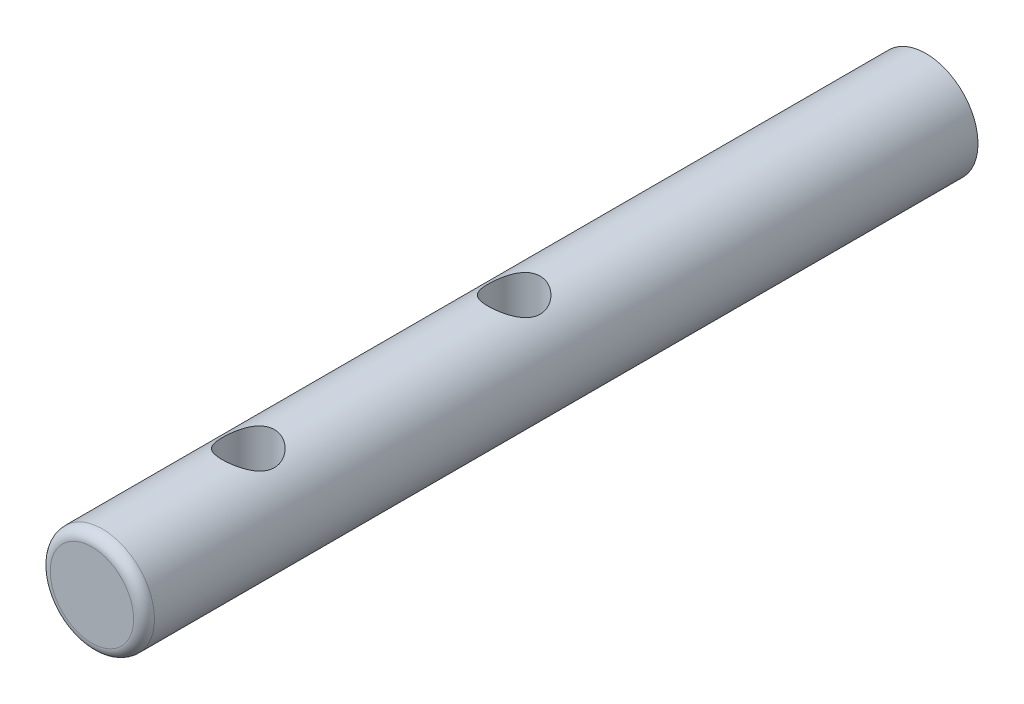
ISO-10303-21;
HEADER;
FILE_DESCRIPTION(('STEP AP214'),'2;1');
FILE_NAME('part.step','',(''),(''),'','','');
FILE_SCHEMA(('AUTOMOTIVE_DESIGN { 1 0 10303 214 1 1 1 1 }'));
ENDSEC;
DATA;
#1=APPLICATION_CONTEXT('core data for automotive mechanical design processes');
#2=APPLICATION_PROTOCOL_DEFINITION('international standard','automotive_design',2000,#1);
#3=PRODUCT_CONTEXT('',#1,'mechanical');
#4=PRODUCT('Part','Part','',(#3));
#5=PRODUCT_RELATED_PRODUCT_CATEGORY('part','',(#4));
#6=PRODUCT_DEFINITION_FORMATION('','',#4);
#7=PRODUCT_DEFINITION_CONTEXT('part definition',#1,'design');
#8=PRODUCT_DEFINITION('design','',#6,#7);
#9=PRODUCT_DEFINITION_SHAPE('','',#8);
#10=(LENGTH_UNIT() NAMED_UNIT(*) SI_UNIT(.MILLI.,.METRE.));
#11=(NAMED_UNIT(*) PLANE_ANGLE_UNIT() SI_UNIT($,.RADIAN.));
#12=(NAMED_UNIT(*) SI_UNIT($,.STERADIAN.) SOLID_ANGLE_UNIT());
#13=UNCERTAINTY_MEASURE_WITH_UNIT(LENGTH_MEASURE(1.E-05),#10,'distance_accuracy_value','');
#14=(GEOMETRIC_REPRESENTATION_CONTEXT(3) GLOBAL_UNCERTAINTY_ASSIGNED_CONTEXT((#13)) GLOBAL_UNIT_ASSIGNED_CONTEXT((#10,
#11,#12)) REPRESENTATION_CONTEXT('',''));
#15=CARTESIAN_POINT('',(0.,0.,0.));
#16=DIRECTION('',(0.,0.,1.));
#17=DIRECTION('',(1.,0.,0.));
#18=AXIS2_PLACEMENT_3D('',#15,#16,#17);
#19=CARTESIAN_POINT('',(0.,0.,101.6));
#20=DIRECTION('',(0.,0.,-1.));
#21=DIRECTION('',(-1.,0.,0.));
#22=AXIS2_PLACEMENT_3D('',#19,#20,#21);
#23=CYLINDRICAL_SURFACE('',#22,6.35);
#24=CARTESIAN_POINT('',(1.52655665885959E-13,6.35,46.9899999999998));
#25=CARTESIAN_POINT('',(0.0834969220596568,6.34999931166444,46.9900008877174));
#26=CARTESIAN_POINT('',(0.167002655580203,6.34834758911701,46.9932998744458));
#27=CARTESIAN_POINT('',(0.333378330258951,6.34179105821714,47.0064458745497));
#28=CARTESIAN_POINT('',(0.416247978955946,6.33688483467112,47.0162957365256));
#29=CARTESIAN_POINT('',(0.663182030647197,6.31742426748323,47.0555720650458));
#30=CARTESIAN_POINT('',(0.825450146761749,6.29812827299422,47.0947250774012));
#31=CARTESIAN_POINT('',(1.13965128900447,6.24891823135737,47.196990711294));
#32=CARTESIAN_POINT('',(1.2916218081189,6.2190454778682,47.2600102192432));
#33=CARTESIAN_POINT('',(1.58264035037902,6.15142812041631,47.4077360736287));
#34=CARTESIAN_POINT('',(1.72168939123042,6.1136841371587,47.4924407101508));
#35=CARTESIAN_POINT('',(1.99234108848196,6.03111096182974,47.6869696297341));
#36=CARTESIAN_POINT('',(2.12298433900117,5.98599127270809,47.7980035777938));
#37=CARTESIAN_POINT('',(2.36467069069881,5.89470535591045,48.0393966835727));
#38=CARTESIAN_POINT('',(2.47569885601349,5.84853836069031,48.1697704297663));
#39=CARTESIAN_POINT('',(2.68368848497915,5.75623634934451,48.4584209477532));
#40=CARTESIAN_POINT('',(2.77889135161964,5.71038146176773,48.6180775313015));
#41=CARTESIAN_POINT('',(2.90019349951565,5.64919759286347,48.8695479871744));
#42=CARTESIAN_POINT('',(2.93705266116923,5.63006420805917,48.9554000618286));
#43=CARTESIAN_POINT('',(3.00322508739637,5.59504604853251,49.1305856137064));
#44=CARTESIAN_POINT('',(3.0325428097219,5.57915935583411,49.2199169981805));
#45=CARTESIAN_POINT('',(3.08174263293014,5.55212611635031,49.3960105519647));
#46=CARTESIAN_POINT('',(3.1020812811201,5.54075429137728,49.4826107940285));
#47=CARTESIAN_POINT('',(3.13545600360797,5.52193654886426,49.6575872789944));
#48=CARTESIAN_POINT('',(3.1484959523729,5.51448854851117,49.7459625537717));
#49=CARTESIAN_POINT('',(3.16707713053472,5.503838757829,49.9237067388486));
#50=CARTESIAN_POINT('',(3.17262287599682,5.50063441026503,50.0130750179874));
#51=CARTESIAN_POINT('',(3.17614778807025,5.4985978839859,50.1919807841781));
#52=CARTESIAN_POINT('',(3.17412767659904,5.4997652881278,50.2815182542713));
#53=CARTESIAN_POINT('',(3.15811930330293,5.50899190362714,50.5277478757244));
#54=CARTESIAN_POINT('',(3.13621253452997,5.52160857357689,50.6838417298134));
#55=CARTESIAN_POINT('',(3.070037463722,5.55866493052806,50.9896466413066));
#56=CARTESIAN_POINT('',(3.02576203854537,5.58310838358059,51.1393556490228));
#57=CARTESIAN_POINT('',(2.91531509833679,5.6415788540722,51.4325442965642));
#58=CARTESIAN_POINT('',(2.8486575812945,5.67581583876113,51.5757976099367));
#59=CARTESIAN_POINT('',(2.69570761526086,5.75003268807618,51.8497660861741));
#60=CARTESIAN_POINT('',(2.60940634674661,5.79001512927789,51.9804755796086));
#61=CARTESIAN_POINT('',(2.40685964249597,5.87734289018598,52.2431042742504));
#62=CARTESIAN_POINT('',(2.28820488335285,5.92497898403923,52.3730753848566));
#63=CARTESIAN_POINT('',(2.03058898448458,6.01813700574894,52.6120851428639));
#64=CARTESIAN_POINT('',(1.89161819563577,6.06365791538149,52.7211137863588));
#65=CARTESIAN_POINT('',(1.58913989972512,6.15003810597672,52.9199019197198));
#66=CARTESIAN_POINT('',(1.42479265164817,6.19058274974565,53.0085314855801));
#67=CARTESIAN_POINT('',(1.08098023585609,6.25976272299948,53.1561580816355));
#68=CARTESIAN_POINT('',(0.901527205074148,6.28840750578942,53.2151786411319));
#69=CARTESIAN_POINT('',(0.548533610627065,6.32854759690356,53.2970594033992));
#70=CARTESIAN_POINT('',(0.375734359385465,6.34126679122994,53.3225096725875));
#71=CARTESIAN_POINT('',(0.0278752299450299,6.35231817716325,53.3446505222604));
#72=CARTESIAN_POINT('',(-0.147183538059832,6.3506571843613,53.3413547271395));
#73=CARTESIAN_POINT('',(-0.480164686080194,6.333845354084,53.3075937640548));
#74=CARTESIAN_POINT('',(-0.63836362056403,6.31975005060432,53.2792542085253));
#75=CARTESIAN_POINT('',(-0.947441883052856,6.28085393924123,53.1995441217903));
#76=CARTESIAN_POINT('',(-1.09832040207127,6.25605195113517,53.1481710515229));
#77=CARTESIAN_POINT('',(-1.393471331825,6.19709998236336,53.0225048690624));
#78=CARTESIAN_POINT('',(-1.53743151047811,6.1627029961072,52.947598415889));
#79=CARTESIAN_POINT('',(-1.8112148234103,6.08787118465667,52.7776835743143));
#80=CARTESIAN_POINT('',(-1.94103189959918,6.04743378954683,52.6826666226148));
#81=CARTESIAN_POINT('',(-2.19636241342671,5.95973602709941,52.4644606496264));
#82=CARTESIAN_POINT('',(-2.32020134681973,5.91219559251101,52.3394213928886));
#83=CARTESIAN_POINT('',(-2.54589381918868,5.81858093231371,52.0702376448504));
#84=CARTESIAN_POINT('',(-2.64773214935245,5.77250773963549,51.9260800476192));
#85=CARTESIAN_POINT('',(-2.83117262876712,5.68487535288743,51.6139313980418));
#86=CARTESIAN_POINT('',(-2.91155594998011,5.64364281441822,51.4451242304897));
#87=CARTESIAN_POINT('',(-3.04191297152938,5.5744767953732,51.0936555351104));
#88=CARTESIAN_POINT('',(-3.09192585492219,5.54652618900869,50.9110122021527));
#89=CARTESIAN_POINT('',(-3.15551086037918,5.51057765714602,50.5558100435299));
#90=CARTESIAN_POINT('',(-3.17212027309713,5.50092192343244,50.3839662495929));
#91=CARTESIAN_POINT('',(-3.17718805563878,5.49800001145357,50.0397555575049));
#92=CARTESIAN_POINT('',(-3.16565862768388,5.50472672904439,49.8673889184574));
#93=CARTESIAN_POINT('',(-3.11761548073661,5.53205211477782,49.5443398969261));
#94=CARTESIAN_POINT('',(-3.08358651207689,5.55126823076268,49.3931560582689));
#95=CARTESIAN_POINT('',(-2.9945816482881,5.5997797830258,49.0988091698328));
#96=CARTESIAN_POINT('',(-2.93959901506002,5.62907846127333,48.9556487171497));
#97=CARTESIAN_POINT('',(-2.80611544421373,5.69685576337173,48.6707663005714));
#98=CARTESIAN_POINT('',(-2.72628260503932,5.73581889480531,48.5297871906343));
#99=CARTESIAN_POINT('',(-2.54682759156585,5.81772207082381,48.2623025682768));
#100=CARTESIAN_POINT('',(-2.44719512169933,5.86066417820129,48.1358046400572));
#101=CARTESIAN_POINT('',(-2.2168028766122,5.95192753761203,47.8849024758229));
#102=CARTESIAN_POINT('',(-2.08373188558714,6.00026839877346,47.7626202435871));
#103=CARTESIAN_POINT('',(-1.79751265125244,6.0921234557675,47.5416021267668));
#104=CARTESIAN_POINT('',(-1.64435365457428,6.13563504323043,47.4428789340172));
#105=CARTESIAN_POINT('',(-1.40178715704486,6.19391073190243,47.3147197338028));
#106=CARTESIAN_POINT('',(-1.31842200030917,6.21223173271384,47.2751994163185));
#107=CARTESIAN_POINT('',(-1.14807701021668,6.24595363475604,47.2034005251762));
#108=CARTESIAN_POINT('',(-1.06109897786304,6.26135597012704,47.1711183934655));
#109=CARTESIAN_POINT('',(-0.884361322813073,6.28875097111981,47.1142406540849));
#110=CARTESIAN_POINT('',(-0.794608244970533,6.30075106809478,47.0896282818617));
#111=CARTESIAN_POINT('',(-0.612925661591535,6.32100983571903,47.0483326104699));
#112=CARTESIAN_POINT('',(-0.520997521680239,6.32927079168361,47.0316444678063));
#113=CARTESIAN_POINT('',(-0.357531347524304,6.34032503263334,47.0093837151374));
#114=CARTESIAN_POINT('',(-0.286274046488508,6.34394670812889,47.0021211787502));
#115=CARTESIAN_POINT('',(-0.143346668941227,6.34878452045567,46.9924288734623));
#116=CARTESIAN_POINT('',(-0.0716765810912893,6.35000059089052,46.989999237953));
#117=CARTESIAN_POINT('',(1.52655665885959E-13,6.35,46.9899999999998));
#118=B_SPLINE_CURVE_WITH_KNOTS('',3,(#24,#25,#26,#27,#28,#29,#30,#31,#32,#33,#34,#35,#36,#37,
#38,#39,#40,#41,#42,#43,#44,#45,#46,#47,#48,#49,#50,#51,#52,#53,#54,#55,#56,#57,#58,#59,#60,#61,
#62,#63,#64,#65,#66,#67,#68,#69,#70,#71,#72,#73,#74,#75,#76,#77,#78,#79,#80,#81,#82,#83,#84,#85,
#86,#87,#88,#89,#90,#91,#92,#93,#94,#95,#96,#97,#98,#99,#100,#101,#102,#103,#104,#105,#106,#107,
#108,#109,#110,#111,#112,#113,#114,#115,#116,#117),.UNSPECIFIED.,.T.,.F.,(4,2,2,2,2,2,2,2,2,2,2,
2,2,2,2,2,2,2,2,2,2,2,2,2,2,2,2,2,2,2,2,2,2,2,2,2,2,2,2,2,2,2,2,2,2,2,4),(0.,0.250415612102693,
0.50094018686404,1.00234854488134,1.50182051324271,2.00125310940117,2.53090025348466,
3.06094897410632,3.6321029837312,3.91787290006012,4.20347350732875,4.4721327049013,
4.74064915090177,5.00900371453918,5.27733267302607,5.74927594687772,6.22136960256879,
6.70445970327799,7.18776712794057,7.7323564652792,8.27720530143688,8.84735553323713,
9.41705196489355,9.93956405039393,10.4618285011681,10.9436138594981,11.4254523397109,
11.9210677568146,12.4168946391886,12.9614122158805,13.5063050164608,14.0775857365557,
14.648127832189,15.1639000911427,15.6794487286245,16.1458838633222,16.6124691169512,
17.1104020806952,17.6085946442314,18.1673210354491,18.7263477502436,19.0082017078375,
19.2899168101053,19.5710117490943,19.8519346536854,20.0668939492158,20.2818591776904),.UNSPECIFIED.);
#119=CARTESIAN_POINT('',(1.52655665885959E-13,6.35,46.9899999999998));
#120=VERTEX_POINT('',#119);
#121=EDGE_CURVE('E11',#120,#120,#118,.T.);
#122=ORIENTED_EDGE('',*,*,#121,.T.);
#123=EDGE_LOOP('',(#122));
#124=FACE_BOUND('',#123,.T.);
#125=CARTESIAN_POINT('',(0.,-6.35,46.9899999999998));
#126=CARTESIAN_POINT('',(-0.0834969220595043,-6.34999931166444,46.9900008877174));
#127=CARTESIAN_POINT('',(-0.167002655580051,-6.34834758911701,46.9932998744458));
#128=CARTESIAN_POINT('',(-0.333378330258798,-6.34179105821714,47.0064458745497));
#129=CARTESIAN_POINT('',(-0.416247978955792,-6.33688483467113,47.0162957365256));
#130=CARTESIAN_POINT('',(-0.663182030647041,-6.31742426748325,47.0555720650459));
#131=CARTESIAN_POINT('',(-0.825450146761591,-6.29812827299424,47.0947250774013));
#132=CARTESIAN_POINT('',(-1.13965128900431,-6.24891823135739,47.196990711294));
#133=CARTESIAN_POINT('',(-1.29162180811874,-6.21904547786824,47.2600102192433));
#134=CARTESIAN_POINT('',(-1.58264035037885,-6.15142812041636,47.4077360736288));
#135=CARTESIAN_POINT('',(-1.72168939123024,-6.11368413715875,47.4924407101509));
#136=CARTESIAN_POINT('',(-1.99234108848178,-6.0311109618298,47.6869696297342));
#137=CARTESIAN_POINT('',(-2.12298433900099,-5.98599127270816,47.7980035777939));
#138=CARTESIAN_POINT('',(-2.36467069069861,-5.89470535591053,48.0393966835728));
#139=CARTESIAN_POINT('',(-2.47569885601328,-5.8485383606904,48.1697704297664));
#140=CARTESIAN_POINT('',(-2.68368848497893,-5.75623634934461,48.4584209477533));
#141=CARTESIAN_POINT('',(-2.77889135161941,-5.71038146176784,48.6180775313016));
#142=CARTESIAN_POINT('',(-2.90019349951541,-5.6491975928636,48.8695479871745));
#143=CARTESIAN_POINT('',(-2.93705266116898,-5.63006420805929,48.9554000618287));
#144=CARTESIAN_POINT('',(-3.00322508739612,-5.59504604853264,49.1305856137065));
#145=CARTESIAN_POINT('',(-3.03254280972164,-5.57915935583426,49.2199169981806));
#146=CARTESIAN_POINT('',(-3.08174263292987,-5.55212611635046,49.3960105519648));
#147=CARTESIAN_POINT('',(-3.10208128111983,-5.54075429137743,49.4826107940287));
#148=CARTESIAN_POINT('',(-3.13545600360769,-5.52193654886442,49.6575872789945));
#149=CARTESIAN_POINT('',(-3.14849595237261,-5.51448854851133,49.7459625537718));
#150=CARTESIAN_POINT('',(-3.16707713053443,-5.50383875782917,49.9237067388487));
#151=CARTESIAN_POINT('',(-3.17262287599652,-5.5006344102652,50.0130750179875));
#152=CARTESIAN_POINT('',(-3.17614778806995,-5.49859788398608,50.1919807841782));
#153=CARTESIAN_POINT('',(-3.17412767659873,-5.49976528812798,50.2815182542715));
#154=CARTESIAN_POINT('',(-3.1581193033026,-5.50899190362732,50.5277478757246));
#155=CARTESIAN_POINT('',(-3.13621253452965,-5.52160857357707,50.6838417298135));
#156=CARTESIAN_POINT('',(-3.07003746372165,-5.55866493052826,50.9896466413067));
#157=CARTESIAN_POINT('',(-3.02576203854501,-5.58310838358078,51.1393556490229));
#158=CARTESIAN_POINT('',(-2.91531509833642,-5.64157885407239,51.4325442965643));
#159=CARTESIAN_POINT('',(-2.84865758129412,-5.67581583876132,51.5757976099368));
#160=CARTESIAN_POINT('',(-2.69570761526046,-5.75003268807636,51.8497660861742));
#161=CARTESIAN_POINT('',(-2.6094063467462,-5.79001512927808,51.9804755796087));
#162=CARTESIAN_POINT('',(-2.40685964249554,-5.87734289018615,52.2431042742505));
#163=CARTESIAN_POINT('',(-2.2882048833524,-5.92497898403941,52.3730753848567));
#164=CARTESIAN_POINT('',(-2.03058898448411,-6.0181370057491,52.6120851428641));
#165=CARTESIAN_POINT('',(-1.89161819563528,-6.06365791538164,52.7211137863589));
#166=CARTESIAN_POINT('',(-1.58913989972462,-6.15003810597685,52.9199019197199));
#167=CARTESIAN_POINT('',(-1.42479265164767,-6.19058274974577,53.0085314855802));
#168=CARTESIAN_POINT('',(-1.08098023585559,-6.25976272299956,53.1561580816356));
#169=CARTESIAN_POINT('',(-0.901527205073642,-6.2884075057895,53.2151786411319));
#170=CARTESIAN_POINT('',(-0.548533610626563,-6.3285475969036,53.2970594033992));
#171=CARTESIAN_POINT('',(-0.375734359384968,-6.34126679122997,53.3225096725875));
#172=CARTESIAN_POINT('',(-0.0278752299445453,-6.35231817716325,53.3446505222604));
#173=CARTESIAN_POINT('',(0.147183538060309,-6.35065718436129,53.3413547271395));
#174=CARTESIAN_POINT('',(0.480164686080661,-6.33384535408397,53.3075937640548));
#175=CARTESIAN_POINT('',(0.638363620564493,-6.31975005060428,53.2792542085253));
#176=CARTESIAN_POINT('',(0.94744188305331,-6.28085393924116,53.1995441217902));
#177=CARTESIAN_POINT('',(1.09832040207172,-6.25605195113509,53.1481710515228));
#178=CARTESIAN_POINT('',(1.39347133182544,-6.19709998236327,53.0225048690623));
#179=CARTESIAN_POINT('',(1.53743151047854,-6.16270299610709,52.9475984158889));
#180=CARTESIAN_POINT('',(1.81121482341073,-6.08787118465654,52.7776835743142));
#181=CARTESIAN_POINT('',(1.94103189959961,-6.04743378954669,52.6826666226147));
#182=CARTESIAN_POINT('',(2.19636241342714,-5.95973602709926,52.4644606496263));
#183=CARTESIAN_POINT('',(2.32020134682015,-5.91219559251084,52.3394213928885));
#184=CARTESIAN_POINT('',(2.54589381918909,-5.81858093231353,52.0702376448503));
#185=CARTESIAN_POINT('',(2.64773214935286,-5.7725077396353,51.9260800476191));
#186=CARTESIAN_POINT('',(2.83117262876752,-5.68487535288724,51.6139313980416));
#187=CARTESIAN_POINT('',(2.91155594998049,-5.64364281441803,51.4451242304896));
#188=CARTESIAN_POINT('',(3.04191297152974,-5.57447679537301,51.0936555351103));
#189=CARTESIAN_POINT('',(3.09192585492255,-5.54652618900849,50.9110122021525));
#190=CARTESIAN_POINT('',(3.15551086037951,-5.51057765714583,50.5558100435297));
#191=CARTESIAN_POINT('',(3.17212027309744,-5.50092192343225,50.3839662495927));
#192=CARTESIAN_POINT('',(3.17718805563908,-5.4980000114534,50.0397555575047));
#193=CARTESIAN_POINT('',(3.16565862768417,-5.50472672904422,49.8673889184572));
#194=CARTESIAN_POINT('',(3.11761548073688,-5.53205211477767,49.5443398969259));
#195=CARTESIAN_POINT('',(3.08358651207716,-5.55126823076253,49.3931560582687));
#196=CARTESIAN_POINT('',(2.99458164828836,-5.59977978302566,49.0988091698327));
#197=CARTESIAN_POINT('',(2.93959901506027,-5.6290784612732,48.9556487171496));
#198=CARTESIAN_POINT('',(2.80611544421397,-5.69685576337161,48.6707663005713));
#199=CARTESIAN_POINT('',(2.72628260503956,-5.7358188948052,48.5297871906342));
#200=CARTESIAN_POINT('',(2.54682759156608,-5.81772207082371,48.2623025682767));
#201=CARTESIAN_POINT('',(2.44719512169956,-5.8606641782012,48.1358046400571));
#202=CARTESIAN_POINT('',(2.21680287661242,-5.95192753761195,47.8849024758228));
#203=CARTESIAN_POINT('',(2.08373188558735,-6.00026839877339,47.762620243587));
#204=CARTESIAN_POINT('',(1.79751265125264,-6.09212345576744,47.5416021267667));
#205=CARTESIAN_POINT('',(1.64435365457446,-6.13563504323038,47.4428789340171));
#206=CARTESIAN_POINT('',(1.40178715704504,-6.19391073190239,47.3147197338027));
#207=CARTESIAN_POINT('',(1.31842200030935,-6.2122317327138,47.2751994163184));
#208=CARTESIAN_POINT('',(1.14807701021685,-6.24595363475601,47.2034005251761));
#209=CARTESIAN_POINT('',(1.0610989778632,-6.26135597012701,47.1711183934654));
#210=CARTESIAN_POINT('',(0.884361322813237,-6.28875097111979,47.1142406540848));
#211=CARTESIAN_POINT('',(0.794608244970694,-6.30075106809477,47.0896282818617));
#212=CARTESIAN_POINT('',(0.612925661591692,-6.32100983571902,47.0483326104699));
#213=CARTESIAN_POINT('',(0.520997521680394,-6.32927079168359,47.0316444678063));
#214=CARTESIAN_POINT('',(0.357531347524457,-6.34032503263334,47.0093837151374));
#215=CARTESIAN_POINT('',(0.286274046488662,-6.34394670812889,47.0021211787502));
#216=CARTESIAN_POINT('',(0.143346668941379,-6.34878452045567,46.9924288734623));
#217=CARTESIAN_POINT('',(0.0716765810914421,-6.35000059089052,46.989999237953));
#218=CARTESIAN_POINT('',(0.,-6.35,46.9899999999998));
#219=B_SPLINE_CURVE_WITH_KNOTS('',3,(#125,#126,#127,#128,#129,#130,#131,#132,#133,#134,#135,
#136,#137,#138,#139,#140,#141,#142,#143,#144,#145,#146,#147,#148,#149,#150,#151,#152,#153,#154,
#155,#156,#157,#158,#159,#160,#161,#162,#163,#164,#165,#166,#167,#168,#169,#170,#171,#172,#173,
#174,#175,#176,#177,#178,#179,#180,#181,#182,#183,#184,#185,#186,#187,#188,#189,#190,#191,#192,
#193,#194,#195,#196,#197,#198,#199,#200,#201,#202,#203,#204,#205,#206,#207,#208,#209,#210,#211,
#212,#213,#214,#215,#216,#217,#218),.UNSPECIFIED.,.T.,.F.,(4,2,2,2,2,2,2,2,2,2,2,2,2,2,2,2,2,2,
2,2,2,2,2,2,2,2,2,2,2,2,2,2,2,2,2,2,2,2,2,2,2,2,2,2,2,2,4),(0.,0.250415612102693,
0.50094018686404,1.00234854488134,1.50182051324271,2.00125310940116,2.53090025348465,
3.06094897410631,3.63210298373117,3.91787290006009,4.20347350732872,4.47213270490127,
4.74064915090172,5.00900371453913,5.27733267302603,5.74927594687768,6.22136960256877,
6.70445970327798,7.18776712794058,7.73235646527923,8.27720530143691,8.84735553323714,
9.41705196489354,9.9395640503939,10.4618285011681,10.9436138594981,11.4254523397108,
11.9210677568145,12.4168946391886,12.9614122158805,13.5063050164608,14.0775857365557,
14.648127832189,15.1639000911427,15.6794487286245,16.1458838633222,16.6124691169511,
17.1104020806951,17.6085946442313,18.1673210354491,18.7263477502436,19.0082017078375,
19.2899168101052,19.5710117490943,19.8519346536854,20.0668939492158,20.2818591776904),.UNSPECIFIED.);
#220=CARTESIAN_POINT('',(0.,-6.35,46.9899999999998));
#221=VERTEX_POINT('',#220);
#222=EDGE_CURVE('E50',#221,#221,#219,.T.);
#223=ORIENTED_EDGE('',*,*,#222,.T.);
#224=EDGE_LOOP('',(#223));
#225=FACE_BOUND('',#224,.T.);
#226=CARTESIAN_POINT('',(0.,6.35,79.375));
#227=CARTESIAN_POINT('',(0.0834969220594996,6.34999931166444,79.3750008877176));
#228=CARTESIAN_POINT('',(0.167002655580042,6.34834758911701,79.378299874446));
#229=CARTESIAN_POINT('',(0.333378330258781,6.34179105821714,79.3914458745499));
#230=CARTESIAN_POINT('',(0.416247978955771,6.33688483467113,79.4012957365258));
#231=CARTESIAN_POINT('',(0.66318203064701,6.31742426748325,79.440572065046));
#232=CARTESIAN_POINT('',(0.825450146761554,6.29812827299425,79.4797250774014));
#233=CARTESIAN_POINT('',(1.13965128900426,6.2489182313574,79.5819907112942));
#234=CARTESIAN_POINT('',(1.29162180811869,6.21904547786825,79.6450102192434));
#235=CARTESIAN_POINT('',(1.58264035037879,6.15142812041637,79.7927360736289));
#236=CARTESIAN_POINT('',(1.72168939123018,6.11368413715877,79.877440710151));
#237=CARTESIAN_POINT('',(1.99234108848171,6.03111096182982,80.0719696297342));
#238=CARTESIAN_POINT('',(2.12298433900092,5.98599127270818,80.183003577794));
#239=CARTESIAN_POINT('',(2.36467069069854,5.89470535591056,80.4243966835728));
#240=CARTESIAN_POINT('',(2.47569885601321,5.84853836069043,80.5547704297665));
#241=CARTESIAN_POINT('',(2.68368848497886,5.75623634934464,80.8434209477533));
#242=CARTESIAN_POINT('',(2.77889135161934,5.71038146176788,81.0030775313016));
#243=CARTESIAN_POINT('',(2.90019349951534,5.64919759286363,81.2545479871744));
#244=CARTESIAN_POINT('',(2.93705266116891,5.63006420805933,81.3404000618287));
#245=CARTESIAN_POINT('',(3.00322508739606,5.59504604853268,81.5155856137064));
#246=CARTESIAN_POINT('',(3.03254280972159,5.57915935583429,81.6049169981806));
#247=CARTESIAN_POINT('',(3.08174263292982,5.55212611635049,81.7810105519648));
#248=CARTESIAN_POINT('',(3.10208128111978,5.54075429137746,81.8676107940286));
#249=CARTESIAN_POINT('',(3.13545600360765,5.52193654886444,82.0425872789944));
#250=CARTESIAN_POINT('',(3.14849595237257,5.51448854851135,82.1309625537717));
#251=CARTESIAN_POINT('',(3.1670771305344,5.50383875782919,82.3087067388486));
#252=CARTESIAN_POINT('',(3.17262287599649,5.50063441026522,82.3980750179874));
#253=CARTESIAN_POINT('',(3.17614778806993,5.49859788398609,82.5769807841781));
#254=CARTESIAN_POINT('',(3.17412767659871,5.49976528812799,82.6665182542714));
#255=CARTESIAN_POINT('',(3.1581193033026,5.50899190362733,82.9127478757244));
#256=CARTESIAN_POINT('',(3.13621253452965,5.52160857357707,83.0688417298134));
#257=CARTESIAN_POINT('',(3.07003746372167,5.55866493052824,83.3746466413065));
#258=CARTESIAN_POINT('',(3.02576203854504,5.58310838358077,83.5243556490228));
#259=CARTESIAN_POINT('',(2.91531509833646,5.64157885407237,83.8175442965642));
#260=CARTESIAN_POINT('',(2.84865758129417,5.6758158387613,83.9607976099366));
#261=CARTESIAN_POINT('',(2.69570761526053,5.75003268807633,84.234766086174));
#262=CARTESIAN_POINT('',(2.60940634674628,5.79001512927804,84.3654755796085));
#263=CARTESIAN_POINT('',(2.40685964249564,5.87734289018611,84.6281042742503));
#264=CARTESIAN_POINT('',(2.28820488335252,5.92497898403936,84.7580753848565));
#265=CARTESIAN_POINT('',(2.03058898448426,6.01813700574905,84.9970851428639));
#266=CARTESIAN_POINT('',(1.89161819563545,6.06365791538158,85.1061137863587));
#267=CARTESIAN_POINT('',(1.58913989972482,6.1500381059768,85.3049019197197));
#268=CARTESIAN_POINT('',(1.42479265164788,6.19058274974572,85.3935314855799));
#269=CARTESIAN_POINT('',(1.08098023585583,6.25976272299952,85.5411580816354));
#270=CARTESIAN_POINT('',(0.901527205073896,6.28840750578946,85.6001786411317));
#271=CARTESIAN_POINT('',(0.548533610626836,6.32854759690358,85.6820594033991));
#272=CARTESIAN_POINT('',(0.375734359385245,6.34126679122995,85.7075096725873));
#273=CARTESIAN_POINT('',(0.0278752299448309,6.35231817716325,85.7296505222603));
#274=CARTESIAN_POINT('',(-0.147183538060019,6.35065718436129,85.7263547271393));
#275=CARTESIAN_POINT('',(-0.480164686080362,6.33384535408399,85.6925937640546));
#276=CARTESIAN_POINT('',(-0.638363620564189,6.31975005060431,85.6642542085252));
#277=CARTESIAN_POINT('',(-0.947441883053,6.28085393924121,85.5845441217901));
#278=CARTESIAN_POINT('',(-1.09832040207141,6.25605195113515,85.5331710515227));
#279=CARTESIAN_POINT('',(-1.39347133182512,6.19709998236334,85.4075048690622));
#280=CARTESIAN_POINT('',(-1.53743151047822,6.16270299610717,85.3325984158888));
#281=CARTESIAN_POINT('',(-1.8112148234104,6.08787118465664,85.1626835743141));
#282=CARTESIAN_POINT('',(-1.94103189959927,6.0474337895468,85.0676666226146));
#283=CARTESIAN_POINT('',(-2.19636241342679,5.95973602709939,84.8494606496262));
#284=CARTESIAN_POINT('',(-2.3202013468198,5.91219559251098,84.7244213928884));
#285=CARTESIAN_POINT('',(-2.54589381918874,5.81858093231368,84.4552376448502));
#286=CARTESIAN_POINT('',(-2.6477321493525,5.77250773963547,84.3110800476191));
#287=CARTESIAN_POINT('',(-2.83117262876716,5.68487535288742,83.9989313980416));
#288=CARTESIAN_POINT('',(-2.91155594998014,5.64364281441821,83.8301242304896));
#289=CARTESIAN_POINT('',(-3.04191297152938,5.5744767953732,83.4786555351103));
#290=CARTESIAN_POINT('',(-3.09192585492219,5.54652618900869,83.2960122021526));
#291=CARTESIAN_POINT('',(-3.15551086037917,5.51057765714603,82.9408100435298));
#292=CARTESIAN_POINT('',(-3.17212027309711,5.50092192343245,82.7689662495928));
#293=CARTESIAN_POINT('',(-3.17718805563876,5.49800001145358,82.4247555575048));
#294=CARTESIAN_POINT('',(-3.16565862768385,5.50472672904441,82.2523889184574));
#295=CARTESIAN_POINT('',(-3.11761548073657,5.53205211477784,81.9293398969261));
#296=CARTESIAN_POINT('',(-3.08358651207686,5.5512682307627,81.7781560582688));
#297=CARTESIAN_POINT('',(-2.99458164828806,5.59977978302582,81.4838091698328));
#298=CARTESIAN_POINT('',(-2.93959901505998,5.62907846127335,81.3406487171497));
#299=CARTESIAN_POINT('',(-2.80611544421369,5.69685576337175,81.0557663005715));
#300=CARTESIAN_POINT('',(-2.72628260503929,5.73581889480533,80.9147871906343));
#301=CARTESIAN_POINT('',(-2.54682759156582,5.81772207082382,80.6473025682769));
#302=CARTESIAN_POINT('',(-2.4471951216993,5.86066417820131,80.5208046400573));
#303=CARTESIAN_POINT('',(-2.21680287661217,5.95192753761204,80.2699024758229));
#304=CARTESIAN_POINT('',(-2.08373188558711,6.00026839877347,80.1476202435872));
#305=CARTESIAN_POINT('',(-1.79751265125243,6.0921234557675,79.9266021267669));
#306=CARTESIAN_POINT('',(-1.64435365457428,6.13563504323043,79.8278789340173));
#307=CARTESIAN_POINT('',(-1.40178715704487,6.19391073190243,79.6997197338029));
#308=CARTESIAN_POINT('',(-1.31842200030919,6.21223173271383,79.6601994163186));
#309=CARTESIAN_POINT('',(-1.14807701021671,6.24595363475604,79.5884005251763));
#310=CARTESIAN_POINT('',(-1.06109897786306,6.26135597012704,79.5561183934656));
#311=CARTESIAN_POINT('',(-0.884361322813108,6.28875097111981,79.499240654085));
#312=CARTESIAN_POINT('',(-0.794608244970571,6.30075106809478,79.4746282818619));
#313=CARTESIAN_POINT('',(-0.61292566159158,6.32100983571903,79.4333326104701));
#314=CARTESIAN_POINT('',(-0.520997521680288,6.3292707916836,79.4166444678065));
#315=CARTESIAN_POINT('',(-0.357531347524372,6.34032503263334,79.3943837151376));
#316=CARTESIAN_POINT('',(-0.286274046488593,6.34394670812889,79.3871211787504));
#317=CARTESIAN_POINT('',(-0.143346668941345,6.34878452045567,79.3774288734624));
#318=CARTESIAN_POINT('',(-0.0716765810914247,6.35000059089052,79.3749992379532));
#319=CARTESIAN_POINT('',(0.,6.35,79.375));
#320=B_SPLINE_CURVE_WITH_KNOTS('',3,(#226,#227,#228,#229,#230,#231,#232,#233,#234,#235,#236,
#237,#238,#239,#240,#241,#242,#243,#244,#245,#246,#247,#248,#249,#250,#251,#252,#253,#254,#255,
#256,#257,#258,#259,#260,#261,#262,#263,#264,#265,#266,#267,#268,#269,#270,#271,#272,#273,#274,
#275,#276,#277,#278,#279,#280,#281,#282,#283,#284,#285,#286,#287,#288,#289,#290,#291,#292,#293,
#294,#295,#296,#297,#298,#299,#300,#301,#302,#303,#304,#305,#306,#307,#308,#309,#310,#311,#312,
#313,#314,#315,#316,#317,#318,#319),.UNSPECIFIED.,.T.,.F.,(4,2,2,2,2,2,2,2,2,2,2,2,2,2,2,2,2,2,
2,2,2,2,2,2,2,2,2,2,2,2,2,2,2,2,2,2,2,2,2,2,2,2,2,2,2,2,4),(0.,0.25041561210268,
0.500940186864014,1.00234854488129,1.50182051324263,2.00125310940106,2.53090025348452,
3.06094897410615,3.63210298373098,3.91787290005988,4.20347350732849,4.47213270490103,
4.74064915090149,5.00900371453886,5.27733267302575,5.74927594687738,6.22136960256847,
6.70445970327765,7.18776712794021,7.73235646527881,8.27720530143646,8.84735553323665,
9.41705196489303,9.93956405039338,10.4618285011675,10.9436138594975,11.4254523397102,
11.9210677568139,12.4168946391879,12.9614122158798,13.5063050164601,14.0775857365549,
14.6481278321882,15.1639000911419,15.6794487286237,16.1458838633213,16.6124691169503,
17.1104020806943,17.6085946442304,18.1673210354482,18.7263477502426,19.0082017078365,
19.2899168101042,19.5710117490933,19.8519346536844,20.0668939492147,20.2818591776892),.UNSPECIFIED.);
#321=CARTESIAN_POINT('',(0.,6.35,79.375));
#322=VERTEX_POINT('',#321);
#323=EDGE_CURVE('E84',#322,#322,#320,.T.);
#324=ORIENTED_EDGE('',*,*,#323,.T.);
#325=EDGE_LOOP('',(#324));
#326=FACE_BOUND('',#325,.T.);
#327=CARTESIAN_POINT('',(0.,-6.35,79.375));
#328=CARTESIAN_POINT('',(-0.0834969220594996,-6.34999931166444,79.3750008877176));
#329=CARTESIAN_POINT('',(-0.167002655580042,-6.34834758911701,79.378299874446));
#330=CARTESIAN_POINT('',(-0.333378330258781,-6.34179105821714,79.3914458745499));
#331=CARTESIAN_POINT('',(-0.416247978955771,-6.33688483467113,79.4012957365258));
#332=CARTESIAN_POINT('',(-0.66318203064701,-6.31742426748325,79.440572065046));
#333=CARTESIAN_POINT('',(-0.825450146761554,-6.29812827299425,79.4797250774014));
#334=CARTESIAN_POINT('',(-1.13965128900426,-6.2489182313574,79.5819907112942));
#335=CARTESIAN_POINT('',(-1.29162180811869,-6.21904547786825,79.6450102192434));
#336=CARTESIAN_POINT('',(-1.58264035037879,-6.15142812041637,79.7927360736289));
#337=CARTESIAN_POINT('',(-1.72168939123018,-6.11368413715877,79.877440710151));
#338=CARTESIAN_POINT('',(-1.99234108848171,-6.03111096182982,80.0719696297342));
#339=CARTESIAN_POINT('',(-2.12298433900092,-5.98599127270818,80.183003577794));
#340=CARTESIAN_POINT('',(-2.36467069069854,-5.89470535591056,80.4243966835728));
#341=CARTESIAN_POINT('',(-2.47569885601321,-5.84853836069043,80.5547704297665));
#342=CARTESIAN_POINT('',(-2.68368848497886,-5.75623634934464,80.8434209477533));
#343=CARTESIAN_POINT('',(-2.77889135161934,-5.71038146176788,81.0030775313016));
#344=CARTESIAN_POINT('',(-2.90019349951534,-5.64919759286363,81.2545479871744));
#345=CARTESIAN_POINT('',(-2.93705266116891,-5.63006420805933,81.3404000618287));
#346=CARTESIAN_POINT('',(-3.00322508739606,-5.59504604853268,81.5155856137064));
#347=CARTESIAN_POINT('',(-3.03254280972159,-5.57915935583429,81.6049169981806));
#348=CARTESIAN_POINT('',(-3.08174263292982,-5.55212611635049,81.7810105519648));
#349=CARTESIAN_POINT('',(-3.10208128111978,-5.54075429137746,81.8676107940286));
#350=CARTESIAN_POINT('',(-3.13545600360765,-5.52193654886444,82.0425872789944));
#351=CARTESIAN_POINT('',(-3.14849595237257,-5.51448854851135,82.1309625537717));
#352=CARTESIAN_POINT('',(-3.1670771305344,-5.50383875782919,82.3087067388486));
#353=CARTESIAN_POINT('',(-3.17262287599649,-5.50063441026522,82.3980750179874));
#354=CARTESIAN_POINT('',(-3.17614778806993,-5.49859788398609,82.5769807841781));
#355=CARTESIAN_POINT('',(-3.17412767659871,-5.49976528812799,82.6665182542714));
#356=CARTESIAN_POINT('',(-3.1581193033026,-5.50899190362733,82.9127478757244));
#357=CARTESIAN_POINT('',(-3.13621253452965,-5.52160857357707,83.0688417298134));
#358=CARTESIAN_POINT('',(-3.07003746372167,-5.55866493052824,83.3746466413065));
#359=CARTESIAN_POINT('',(-3.02576203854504,-5.58310838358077,83.5243556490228));
#360=CARTESIAN_POINT('',(-2.91531509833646,-5.64157885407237,83.8175442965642));
#361=CARTESIAN_POINT('',(-2.84865758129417,-5.6758158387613,83.9607976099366));
#362=CARTESIAN_POINT('',(-2.69570761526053,-5.75003268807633,84.234766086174));
#363=CARTESIAN_POINT('',(-2.60940634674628,-5.79001512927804,84.3654755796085));
#364=CARTESIAN_POINT('',(-2.40685964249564,-5.87734289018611,84.6281042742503));
#365=CARTESIAN_POINT('',(-2.28820488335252,-5.92497898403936,84.7580753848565));
#366=CARTESIAN_POINT('',(-2.03058898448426,-6.01813700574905,84.9970851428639));
#367=CARTESIAN_POINT('',(-1.89161819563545,-6.06365791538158,85.1061137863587));
#368=CARTESIAN_POINT('',(-1.58913989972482,-6.1500381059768,85.3049019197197));
#369=CARTESIAN_POINT('',(-1.42479265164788,-6.19058274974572,85.3935314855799));
#370=CARTESIAN_POINT('',(-1.08098023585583,-6.25976272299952,85.5411580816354));
#371=CARTESIAN_POINT('',(-0.901527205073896,-6.28840750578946,85.6001786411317));
#372=CARTESIAN_POINT('',(-0.548533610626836,-6.32854759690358,85.6820594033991));
#373=CARTESIAN_POINT('',(-0.375734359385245,-6.34126679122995,85.7075096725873));
#374=CARTESIAN_POINT('',(-0.0278752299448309,-6.35231817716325,85.7296505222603));
#375=CARTESIAN_POINT('',(0.147183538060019,-6.35065718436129,85.7263547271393));
#376=CARTESIAN_POINT('',(0.480164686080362,-6.33384535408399,85.6925937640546));
#377=CARTESIAN_POINT('',(0.638363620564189,-6.31975005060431,85.6642542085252));
#378=CARTESIAN_POINT('',(0.947441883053,-6.28085393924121,85.5845441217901));
#379=CARTESIAN_POINT('',(1.09832040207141,-6.25605195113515,85.5331710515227));
#380=CARTESIAN_POINT('',(1.39347133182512,-6.19709998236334,85.4075048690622));
#381=CARTESIAN_POINT('',(1.53743151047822,-6.16270299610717,85.3325984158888));
#382=CARTESIAN_POINT('',(1.8112148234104,-6.08787118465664,85.1626835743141));
#383=CARTESIAN_POINT('',(1.94103189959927,-6.0474337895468,85.0676666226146));
#384=CARTESIAN_POINT('',(2.19636241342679,-5.95973602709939,84.8494606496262));
#385=CARTESIAN_POINT('',(2.3202013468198,-5.91219559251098,84.7244213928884));
#386=CARTESIAN_POINT('',(2.54589381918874,-5.81858093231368,84.4552376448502));
#387=CARTESIAN_POINT('',(2.6477321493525,-5.77250773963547,84.3110800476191));
#388=CARTESIAN_POINT('',(2.83117262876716,-5.68487535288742,83.9989313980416));
#389=CARTESIAN_POINT('',(2.91155594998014,-5.64364281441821,83.8301242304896));
#390=CARTESIAN_POINT('',(3.04191297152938,-5.5744767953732,83.4786555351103));
#391=CARTESIAN_POINT('',(3.09192585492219,-5.54652618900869,83.2960122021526));
#392=CARTESIAN_POINT('',(3.15551086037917,-5.51057765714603,82.9408100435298));
#393=CARTESIAN_POINT('',(3.17212027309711,-5.50092192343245,82.7689662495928));
#394=CARTESIAN_POINT('',(3.17718805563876,-5.49800001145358,82.4247555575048));
#395=CARTESIAN_POINT('',(3.16565862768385,-5.50472672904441,82.2523889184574));
#396=CARTESIAN_POINT('',(3.11761548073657,-5.53205211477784,81.9293398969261));
#397=CARTESIAN_POINT('',(3.08358651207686,-5.5512682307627,81.7781560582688));
#398=CARTESIAN_POINT('',(2.99458164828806,-5.59977978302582,81.4838091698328));
#399=CARTESIAN_POINT('',(2.93959901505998,-5.62907846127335,81.3406487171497));
#400=CARTESIAN_POINT('',(2.80611544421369,-5.69685576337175,81.0557663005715));
#401=CARTESIAN_POINT('',(2.72628260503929,-5.73581889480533,80.9147871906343));
#402=CARTESIAN_POINT('',(2.54682759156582,-5.81772207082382,80.6473025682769));
#403=CARTESIAN_POINT('',(2.4471951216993,-5.86066417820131,80.5208046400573));
#404=CARTESIAN_POINT('',(2.21680287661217,-5.95192753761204,80.2699024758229));
#405=CARTESIAN_POINT('',(2.08373188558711,-6.00026839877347,80.1476202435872));
#406=CARTESIAN_POINT('',(1.79751265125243,-6.0921234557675,79.9266021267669));
#407=CARTESIAN_POINT('',(1.64435365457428,-6.13563504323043,79.8278789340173));
#408=CARTESIAN_POINT('',(1.40178715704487,-6.19391073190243,79.6997197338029));
#409=CARTESIAN_POINT('',(1.31842200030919,-6.21223173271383,79.6601994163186));
#410=CARTESIAN_POINT('',(1.14807701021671,-6.24595363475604,79.5884005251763));
#411=CARTESIAN_POINT('',(1.06109897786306,-6.26135597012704,79.5561183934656));
#412=CARTESIAN_POINT('',(0.884361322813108,-6.28875097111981,79.499240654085));
#413=CARTESIAN_POINT('',(0.794608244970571,-6.30075106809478,79.4746282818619));
#414=CARTESIAN_POINT('',(0.61292566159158,-6.32100983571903,79.4333326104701));
#415=CARTESIAN_POINT('',(0.520997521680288,-6.3292707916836,79.4166444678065));
#416=CARTESIAN_POINT('',(0.357531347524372,-6.34032503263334,79.3943837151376));
#417=CARTESIAN_POINT('',(0.286274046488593,-6.34394670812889,79.3871211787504));
#418=CARTESIAN_POINT('',(0.143346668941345,-6.34878452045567,79.3774288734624));
#419=CARTESIAN_POINT('',(0.0716765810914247,-6.35000059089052,79.3749992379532));
#420=CARTESIAN_POINT('',(0.,-6.35,79.375));
#421=B_SPLINE_CURVE_WITH_KNOTS('',3,(#327,#328,#329,#330,#331,#332,#333,#334,#335,#336,#337,
#338,#339,#340,#341,#342,#343,#344,#345,#346,#347,#348,#349,#350,#351,#352,#353,#354,#355,#356,
#357,#358,#359,#360,#361,#362,#363,#364,#365,#366,#367,#368,#369,#370,#371,#372,#373,#374,#375,
#376,#377,#378,#379,#380,#381,#382,#383,#384,#385,#386,#387,#388,#389,#390,#391,#392,#393,#394,
#395,#396,#397,#398,#399,#400,#401,#402,#403,#404,#405,#406,#407,#408,#409,#410,#411,#412,#413,
#414,#415,#416,#417,#418,#419,#420),.UNSPECIFIED.,.T.,.F.,(4,2,2,2,2,2,2,2,2,2,2,2,2,2,2,2,2,2,
2,2,2,2,2,2,2,2,2,2,2,2,2,2,2,2,2,2,2,2,2,2,2,2,2,2,2,2,4),(0.,0.25041561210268,
0.500940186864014,1.00234854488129,1.50182051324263,2.00125310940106,2.53090025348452,
3.06094897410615,3.63210298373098,3.91787290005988,4.20347350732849,4.47213270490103,
4.74064915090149,5.00900371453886,5.27733267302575,5.74927594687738,6.22136960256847,
6.70445970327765,7.18776712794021,7.73235646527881,8.27720530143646,8.84735553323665,
9.41705196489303,9.93956405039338,10.4618285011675,10.9436138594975,11.4254523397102,
11.9210677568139,12.4168946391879,12.9614122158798,13.5063050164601,14.0775857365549,
14.6481278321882,15.1639000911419,15.6794487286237,16.1458838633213,16.6124691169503,
17.1104020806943,17.6085946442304,18.1673210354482,18.7263477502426,19.0082017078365,
19.2899168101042,19.5710117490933,19.8519346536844,20.0668939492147,20.2818591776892),.UNSPECIFIED.);
#422=CARTESIAN_POINT('',(0.,-6.35,79.375));
#423=VERTEX_POINT('',#422);
#424=EDGE_CURVE('E77',#423,#423,#421,.T.);
#425=ORIENTED_EDGE('',*,*,#424,.T.);
#426=EDGE_LOOP('',(#425));
#427=FACE_BOUND('',#426,.T.);
#428=CARTESIAN_POINT('',(0.,0.,100.33));
#429=DIRECTION('',(0.,0.,1.));
#430=DIRECTION('',(1.,0.,0.));
#431=AXIS2_PLACEMENT_3D('',#428,#429,#430);
#432=CIRCLE('',#431,6.35);
#433=CARTESIAN_POINT('',(6.35,0.,100.33));
#434=VERTEX_POINT('',#433);
#435=EDGE_CURVE('E74',#434,#434,#432,.F.);
#436=ORIENTED_EDGE('',*,*,#435,.T.);
#437=EDGE_LOOP('',(#436));
#438=FACE_BOUND('',#437,.T.);
#439=CARTESIAN_POINT('',(0.,0.,0.));
#440=DIRECTION('',(0.,0.,1.));
#441=DIRECTION('',(1.,0.,0.));
#442=AXIS2_PLACEMENT_3D('',#439,#440,#441);
#443=CIRCLE('',#442,6.35);
#444=CARTESIAN_POINT('',(6.35,0.,0.));
#445=VERTEX_POINT('',#444);
#446=EDGE_CURVE('E63',#445,#445,#443,.T.);
#447=ORIENTED_EDGE('',*,*,#446,.T.);
#448=EDGE_LOOP('',(#447));
#449=FACE_BOUND('',#448,.T.);
#450=ADVANCED_FACE('F39',(#124,#225,#326,#427,#438,#449),#23,.T.);
#451=CARTESIAN_POINT('',(0.,0.,101.6));
#452=DIRECTION('',(0.,0.,1.));
#453=DIRECTION('',(1.,0.,0.));
#454=AXIS2_PLACEMENT_3D('',#451,#452,#453);
#455=PLANE('',#454);
#456=CARTESIAN_POINT('',(0.,0.,101.6));
#457=DIRECTION('',(0.,0.,1.));
#458=DIRECTION('',(1.,0.,0.));
#459=AXIS2_PLACEMENT_3D('',#456,#457,#458);
#460=CIRCLE('',#459,5.08);
#461=CARTESIAN_POINT('',(5.08,0.,101.6));
#462=VERTEX_POINT('',#461);
#463=EDGE_CURVE('E67',#462,#462,#460,.T.);
#464=ORIENTED_EDGE('',*,*,#463,.T.);
#465=EDGE_LOOP('',(#464));
#466=FACE_BOUND('',#465,.T.);
#467=ADVANCED_FACE('F100',(#466),#455,.T.);
#468=CARTESIAN_POINT('',(0.,0.,0.));
#469=DIRECTION('',(0.,0.,1.));
#470=DIRECTION('',(1.,0.,0.));
#471=AXIS2_PLACEMENT_3D('',#468,#469,#470);
#472=PLANE('',#471);
#473=CARTESIAN_POINT('',(0.,0.,0.));
#474=DIRECTION('',(0.,0.,-1.));
#475=DIRECTION('',(-1.,0.,0.));
#476=AXIS2_PLACEMENT_3D('',#473,#474,#475);
#477=CIRCLE('',#476,2.1);
#478=CARTESIAN_POINT('',(-2.1,0.,0.));
#479=VERTEX_POINT('',#478);
#480=EDGE_CURVE('E64',#479,#479,#477,.T.);
#481=ORIENTED_EDGE('',*,*,#480,.F.);
#482=EDGE_LOOP('',(#481));
#483=FACE_BOUND('',#482,.T.);
#484=ORIENTED_EDGE('',*,*,#446,.F.);
#485=EDGE_LOOP('',(#484));
#486=FACE_BOUND('',#485,.T.);
#487=ADVANCED_FACE('F57',(#483,#486),#472,.F.);
#488=CARTESIAN_POINT('',(0.,0.,25.4));
#489=DIRECTION('',(0.,0.,-1.));
#490=DIRECTION('',(-1.,0.,0.));
#491=AXIS2_PLACEMENT_3D('',#488,#489,#490);
#492=CONICAL_SURFACE('',#491,2.09999999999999,1.02974425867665);
#493=CARTESIAN_POINT('',(0.,0.,26.6618072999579));
#494=VERTEX_POINT('',#493);
#495=VERTEX_LOOP('',#494);
#496=FACE_BOUND('',#495,.T.);
#497=CARTESIAN_POINT('',(0.,0.,25.4));
#498=DIRECTION('',(0.,0.,-1.));
#499=DIRECTION('',(-1.,0.,0.));
#500=AXIS2_PLACEMENT_3D('',#497,#498,#499);
#501=CIRCLE('',#500,2.09999999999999);
#502=CARTESIAN_POINT('',(-2.09999999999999,0.,25.4));
#503=VERTEX_POINT('',#502);
#504=EDGE_CURVE('E61',#503,#503,#501,.T.);
#505=ORIENTED_EDGE('',*,*,#504,.T.);
#506=EDGE_LOOP('',(#505));
#507=FACE_BOUND('',#506,.T.);
#508=ADVANCED_FACE('F53',(#496,#507),#492,.F.);
#509=CARTESIAN_POINT('',(0.,0.,0.));
#510=DIRECTION('',(0.,0.,-1.));
#511=DIRECTION('',(-1.,0.,0.));
#512=AXIS2_PLACEMENT_3D('',#509,#510,#511);
#513=CYLINDRICAL_SURFACE('',#512,2.1);
#514=ORIENTED_EDGE('',*,*,#504,.F.);
#515=EDGE_LOOP('',(#514));
#516=FACE_BOUND('',#515,.T.);
#517=ORIENTED_EDGE('',*,*,#480,.T.);
#518=EDGE_LOOP('',(#517));
#519=FACE_BOUND('',#518,.T.);
#520=ADVANCED_FACE('F56',(#516,#519),#513,.F.);
#521=CARTESIAN_POINT('',(0.,0.,100.33));
#522=DIRECTION('',(0.,0.,1.));
#523=DIRECTION('',(1.,0.,0.));
#524=AXIS2_PLACEMENT_3D('',#521,#522,#523);
#525=TOROIDAL_SURFACE('',#524,5.08,1.27);
#526=ORIENTED_EDGE('',*,*,#435,.F.);
#527=EDGE_LOOP('',(#526));
#528=FACE_BOUND('',#527,.T.);
#529=ORIENTED_EDGE('',*,*,#463,.F.);
#530=EDGE_LOOP('',(#529));
#531=FACE_BOUND('',#530,.T.);
#532=ADVANCED_FACE('F41',(#528,#531),#525,.T.);
#533=CARTESIAN_POINT('',(0.,6.35,82.55));
#534=DIRECTION('',(0.,-1.,0.));
#535=DIRECTION('',(0.,0.,-1.));
#536=AXIS2_PLACEMENT_3D('',#533,#534,#535);
#537=CYLINDRICAL_SURFACE('',#536,3.175);
#538=ORIENTED_EDGE('',*,*,#424,.F.);
#539=EDGE_LOOP('',(#538));
#540=FACE_BOUND('',#539,.T.);
#541=ORIENTED_EDGE('',*,*,#323,.F.);
#542=EDGE_LOOP('',(#541));
#543=FACE_BOUND('',#542,.T.);
#544=ADVANCED_FACE('F90',(#540,#543),#537,.F.);
#545=CARTESIAN_POINT('',(1.52655665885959E-13,6.35,50.165));
#546=DIRECTION('',(0.,-1.,0.));
#547=DIRECTION('',(0.,0.,-1.));
#548=AXIS2_PLACEMENT_3D('',#545,#546,#547);
#549=CYLINDRICAL_SURFACE('',#548,3.17500000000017);
#550=ORIENTED_EDGE('',*,*,#222,.F.);
#551=EDGE_LOOP('',(#550));
#552=FACE_BOUND('',#551,.T.);
#553=ORIENTED_EDGE('',*,*,#121,.F.);
#554=EDGE_LOOP('',(#553));
#555=FACE_BOUND('',#554,.T.);
#556=ADVANCED_FACE('F94',(#552,#555),#549,.F.);
#557=CLOSED_SHELL('',(#450,#467,#487,#508,#520,#532,#544,#556));
#558=MANIFOLD_SOLID_BREP('B2',#557);
#559=ADVANCED_BREP_SHAPE_REPRESENTATION('',(#18,#558),#14);
#560=SHAPE_DEFINITION_REPRESENTATION(#9,#559);
ENDSEC;
END-ISO-10303-21;
